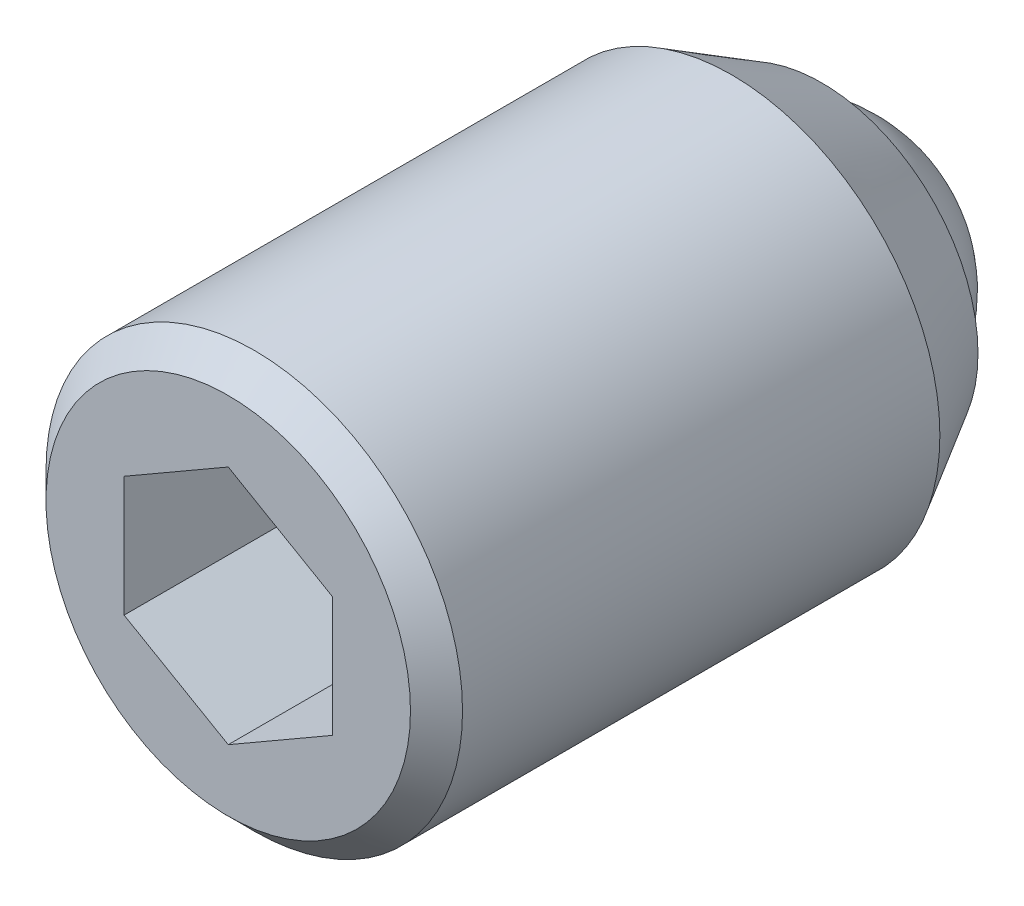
ISO-10303-21;
HEADER;
FILE_DESCRIPTION(('STEP AP214'),'2;1');
FILE_NAME('part.step','',(''),(''),'','','');
FILE_SCHEMA(('AUTOMOTIVE_DESIGN { 1 0 10303 214 1 1 1 1 }'));
ENDSEC;
DATA;
#1=APPLICATION_CONTEXT('core data for automotive mechanical design processes');
#2=APPLICATION_PROTOCOL_DEFINITION('international standard','automotive_design',2000,#1);
#3=PRODUCT_CONTEXT('',#1,'mechanical');
#4=PRODUCT('Part','Part','',(#3));
#5=PRODUCT_RELATED_PRODUCT_CATEGORY('part','',(#4));
#6=PRODUCT_DEFINITION_FORMATION('','',#4);
#7=PRODUCT_DEFINITION_CONTEXT('part definition',#1,'design');
#8=PRODUCT_DEFINITION('design','',#6,#7);
#9=PRODUCT_DEFINITION_SHAPE('','',#8);
#10=(LENGTH_UNIT() NAMED_UNIT(*) SI_UNIT(.MILLI.,.METRE.));
#11=(NAMED_UNIT(*) PLANE_ANGLE_UNIT() SI_UNIT($,.RADIAN.));
#12=(NAMED_UNIT(*) SI_UNIT($,.STERADIAN.) SOLID_ANGLE_UNIT());
#13=UNCERTAINTY_MEASURE_WITH_UNIT(LENGTH_MEASURE(1.E-05),#10,'distance_accuracy_value','');
#14=(GEOMETRIC_REPRESENTATION_CONTEXT(3) GLOBAL_UNCERTAINTY_ASSIGNED_CONTEXT((#13)) GLOBAL_UNIT_ASSIGNED_CONTEXT((#10,
#11,#12)) REPRESENTATION_CONTEXT('',''));
#15=CARTESIAN_POINT('',(0.,0.,0.));
#16=DIRECTION('',(0.,0.,1.));
#17=DIRECTION('',(1.,0.,0.));
#18=AXIS2_PLACEMENT_3D('',#15,#16,#17);
#19=CARTESIAN_POINT('',(2.,1.15470053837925,10.75));
#20=DIRECTION('',(0.5,0.86602540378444,0.));
#21=DIRECTION('',(0.86602540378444,-0.5,0.));
#22=AXIS2_PLACEMENT_3D('',#19,#20,#21);
#23=PLANE('',#22);
#24=DIRECTION('',(0.,0.,1.));
#25=VECTOR('',#24,1.);
#26=CARTESIAN_POINT('',(2.,1.15470053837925,10.75));
#27=LINE('',#26,#25);
#28=CARTESIAN_POINT('',(2.,1.15470053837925,9.25));
#29=VERTEX_POINT('',#28);
#30=CARTESIAN_POINT('',(2.,1.15470053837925,13.25));
#31=VERTEX_POINT('',#30);
#32=EDGE_CURVE('E68',#29,#31,#27,.T.);
#33=ORIENTED_EDGE('',*,*,#32,.T.);
#34=DIRECTION('',(-0.86602540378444,0.5,0.));
#35=VECTOR('',#34,1.);
#36=CARTESIAN_POINT('',(2.,1.15470053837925,13.25));
#37=LINE('',#36,#35);
#38=CARTESIAN_POINT('',(0.,2.3094010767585,13.25));
#39=VERTEX_POINT('',#38);
#40=EDGE_CURVE('E29',#31,#39,#37,.T.);
#41=ORIENTED_EDGE('',*,*,#40,.T.);
#42=DIRECTION('',(0.,0.,1.));
#43=VECTOR('',#42,1.);
#44=CARTESIAN_POINT('',(0.,2.3094010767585,10.75));
#45=LINE('',#44,#43);
#46=CARTESIAN_POINT('',(0.,2.3094010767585,9.25));
#47=VERTEX_POINT('',#46);
#48=EDGE_CURVE('E80',#47,#39,#45,.T.);
#49=ORIENTED_EDGE('',*,*,#48,.F.);
#50=DIRECTION('',(-0.86602540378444,0.5,0.));
#51=VECTOR('',#50,1.);
#52=CARTESIAN_POINT('',(2.,1.15470053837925,9.25));
#53=LINE('',#52,#51);
#54=EDGE_CURVE('E79',#29,#47,#53,.T.);
#55=ORIENTED_EDGE('',*,*,#54,.F.);
#56=EDGE_LOOP('',(#33,#41,#49,#55));
#57=FACE_BOUND('',#56,.T.);
#58=ADVANCED_FACE('F14',(#57),#23,.F.);
#59=CARTESIAN_POINT('',(2.,-1.15470053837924,10.75));
#60=DIRECTION('',(1.,0.,0.));
#61=DIRECTION('',(0.,0.,1.));
#62=AXIS2_PLACEMENT_3D('',#59,#60,#61);
#63=PLANE('',#62);
#64=DIRECTION('',(0.,0.,1.));
#65=VECTOR('',#64,1.);
#66=CARTESIAN_POINT('',(2.,-1.15470053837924,10.75));
#67=LINE('',#66,#65);
#68=CARTESIAN_POINT('',(2.,-1.15470053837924,9.25));
#69=VERTEX_POINT('',#68);
#70=CARTESIAN_POINT('',(2.,-1.15470053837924,13.25));
#71=VERTEX_POINT('',#70);
#72=EDGE_CURVE('E76',#69,#71,#67,.T.);
#73=ORIENTED_EDGE('',*,*,#72,.T.);
#74=DIRECTION('',(0.,1.,0.));
#75=VECTOR('',#74,1.);
#76=CARTESIAN_POINT('',(2.,-1.15470053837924,13.25));
#77=LINE('',#76,#75);
#78=EDGE_CURVE('E75',#71,#31,#77,.T.);
#79=ORIENTED_EDGE('',*,*,#78,.T.);
#80=ORIENTED_EDGE('',*,*,#32,.F.);
#81=DIRECTION('',(0.,1.,0.));
#82=VECTOR('',#81,1.);
#83=CARTESIAN_POINT('',(2.,-1.15470053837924,9.25));
#84=LINE('',#83,#82);
#85=EDGE_CURVE('E72',#69,#29,#84,.T.);
#86=ORIENTED_EDGE('',*,*,#85,.F.);
#87=EDGE_LOOP('',(#73,#79,#80,#86));
#88=FACE_BOUND('',#87,.T.);
#89=ADVANCED_FACE('F70',(#88),#63,.F.);
#90=CARTESIAN_POINT('',(2.,-1.15470053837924,10.75));
#91=DIRECTION('',(-0.5,0.866025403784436,0.));
#92=DIRECTION('',(0.866025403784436,0.5,0.));
#93=AXIS2_PLACEMENT_3D('',#90,#91,#92);
#94=PLANE('',#93);
#95=DIRECTION('',(0.,0.,1.));
#96=VECTOR('',#95,1.);
#97=CARTESIAN_POINT('',(0.,-2.30940107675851,10.75));
#98=LINE('',#97,#96);
#99=CARTESIAN_POINT('',(0.,-2.30940107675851,9.25));
#100=VERTEX_POINT('',#99);
#101=CARTESIAN_POINT('',(0.,-2.30940107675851,13.25));
#102=VERTEX_POINT('',#101);
#103=EDGE_CURVE('E122',#100,#102,#98,.T.);
#104=ORIENTED_EDGE('',*,*,#103,.T.);
#105=DIRECTION('',(-0.866025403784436,-0.5,0.));
#106=VECTOR('',#105,1.);
#107=CARTESIAN_POINT('',(2.,-1.15470053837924,13.25));
#108=LINE('',#107,#106);
#109=EDGE_CURVE('E113',#71,#102,#108,.T.);
#110=ORIENTED_EDGE('',*,*,#109,.F.);
#111=ORIENTED_EDGE('',*,*,#72,.F.);
#112=DIRECTION('',(0.866025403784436,0.5,0.));
#113=VECTOR('',#112,1.);
#114=CARTESIAN_POINT('',(0.,-2.30940107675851,9.25));
#115=LINE('',#114,#113);
#116=EDGE_CURVE('E89',#100,#69,#115,.T.);
#117=ORIENTED_EDGE('',*,*,#116,.F.);
#118=EDGE_LOOP('',(#104,#110,#111,#117));
#119=FACE_BOUND('',#118,.T.);
#120=ADVANCED_FACE('F147',(#119),#94,.T.);
#121=CARTESIAN_POINT('',(-2.,-1.15470053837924,10.75));
#122=DIRECTION('',(-0.5,-0.866025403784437,0.));
#123=DIRECTION('',(-0.866025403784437,0.5,0.));
#124=AXIS2_PLACEMENT_3D('',#121,#122,#123);
#125=PLANE('',#124);
#126=DIRECTION('',(0.,0.,1.));
#127=VECTOR('',#126,1.);
#128=CARTESIAN_POINT('',(-2.,-1.15470053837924,10.75));
#129=LINE('',#128,#127);
#130=CARTESIAN_POINT('',(-2.,-1.15470053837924,9.25));
#131=VERTEX_POINT('',#130);
#132=CARTESIAN_POINT('',(-2.,-1.15470053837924,13.25));
#133=VERTEX_POINT('',#132);
#134=EDGE_CURVE('E120',#131,#133,#129,.T.);
#135=ORIENTED_EDGE('',*,*,#134,.T.);
#136=DIRECTION('',(0.866025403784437,-0.5,0.));
#137=VECTOR('',#136,1.);
#138=CARTESIAN_POINT('',(-2.,-1.15470053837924,13.25));
#139=LINE('',#138,#137);
#140=EDGE_CURVE('E111',#133,#102,#139,.T.);
#141=ORIENTED_EDGE('',*,*,#140,.T.);
#142=ORIENTED_EDGE('',*,*,#103,.F.);
#143=DIRECTION('',(0.866025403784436,-0.5,0.));
#144=VECTOR('',#143,1.);
#145=CARTESIAN_POINT('',(-2.,-1.15470053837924,9.25));
#146=LINE('',#145,#144);
#147=EDGE_CURVE('E101',#131,#100,#146,.T.);
#148=ORIENTED_EDGE('',*,*,#147,.F.);
#149=EDGE_LOOP('',(#135,#141,#142,#148));
#150=FACE_BOUND('',#149,.T.);
#151=ADVANCED_FACE('F157',(#150),#125,.F.);
#152=CARTESIAN_POINT('',(-2.,-1.15470053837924,10.75));
#153=DIRECTION('',(1.,0.,0.));
#154=DIRECTION('',(0.,0.,1.));
#155=AXIS2_PLACEMENT_3D('',#152,#153,#154);
#156=PLANE('',#155);
#157=DIRECTION('',(0.,0.,1.));
#158=VECTOR('',#157,1.);
#159=CARTESIAN_POINT('',(-2.,1.15470053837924,10.75));
#160=LINE('',#159,#158);
#161=CARTESIAN_POINT('',(-2.,1.15470053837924,9.25));
#162=VERTEX_POINT('',#161);
#163=CARTESIAN_POINT('',(-2.,1.15470053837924,13.25));
#164=VERTEX_POINT('',#163);
#165=EDGE_CURVE('E37',#162,#164,#160,.T.);
#166=ORIENTED_EDGE('',*,*,#165,.T.);
#167=DIRECTION('',(0.,1.,0.));
#168=VECTOR('',#167,1.);
#169=CARTESIAN_POINT('',(-2.,-1.15470053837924,13.25));
#170=LINE('',#169,#168);
#171=EDGE_CURVE('E108',#133,#164,#170,.T.);
#172=ORIENTED_EDGE('',*,*,#171,.F.);
#173=ORIENTED_EDGE('',*,*,#134,.F.);
#174=DIRECTION('',(0.,-1.,0.));
#175=VECTOR('',#174,1.);
#176=CARTESIAN_POINT('',(-2.,1.15470053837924,9.25));
#177=LINE('',#176,#175);
#178=EDGE_CURVE('E98',#162,#131,#177,.T.);
#179=ORIENTED_EDGE('',*,*,#178,.F.);
#180=EDGE_LOOP('',(#166,#172,#173,#179));
#181=FACE_BOUND('',#180,.T.);
#182=ADVANCED_FACE('F153',(#181),#156,.T.);
#183=CARTESIAN_POINT('',(-2.,1.15470053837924,10.75));
#184=DIRECTION('',(0.5,-0.866025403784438,0.));
#185=DIRECTION('',(-0.866025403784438,-0.5,0.));
#186=AXIS2_PLACEMENT_3D('',#183,#184,#185);
#187=PLANE('',#186);
#188=ORIENTED_EDGE('',*,*,#165,.F.);
#189=DIRECTION('',(-0.866025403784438,-0.5,0.));
#190=VECTOR('',#189,1.);
#191=CARTESIAN_POINT('',(0.,2.3094010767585,9.25));
#192=LINE('',#191,#190);
#193=EDGE_CURVE('E84',#47,#162,#192,.T.);
#194=ORIENTED_EDGE('',*,*,#193,.F.);
#195=ORIENTED_EDGE('',*,*,#48,.T.);
#196=DIRECTION('',(0.866025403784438,0.5,0.));
#197=VECTOR('',#196,1.);
#198=CARTESIAN_POINT('',(-2.,1.15470053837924,13.25));
#199=LINE('',#198,#197);
#200=EDGE_CURVE('E105',#164,#39,#199,.T.);
#201=ORIENTED_EDGE('',*,*,#200,.F.);
#202=EDGE_LOOP('',(#188,#194,#195,#201));
#203=FACE_BOUND('',#202,.T.);
#204=ADVANCED_FACE('F150',(#203),#187,.T.);
#205=CARTESIAN_POINT('',(0.,0.,13.));
#206=DIRECTION('',(0.,0.,-1.));
#207=DIRECTION('',(1.,0.,0.));
#208=AXIS2_PLACEMENT_3D('',#205,#206,#207);
#209=CYLINDRICAL_SURFACE('',#208,4.);
#210=CARTESIAN_POINT('',(0.,0.,12.75));
#211=DIRECTION('',(0.,0.,-1.));
#212=DIRECTION('',(1.,0.,0.));
#213=AXIS2_PLACEMENT_3D('',#210,#211,#212);
#214=CIRCLE('',#213,4.);
#215=CARTESIAN_POINT('',(4.,0.,12.75));
#216=VERTEX_POINT('',#215);
#217=EDGE_CURVE('E9',#216,#216,#214,.T.);
#218=ORIENTED_EDGE('',*,*,#217,.T.);
#219=EDGE_LOOP('',(#218));
#220=FACE_BOUND('',#219,.T.);
#221=CARTESIAN_POINT('',(0.,0.,3.58205080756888));
#222=DIRECTION('',(0.,0.,-1.));
#223=DIRECTION('',(-1.,0.,0.));
#224=AXIS2_PLACEMENT_3D('',#221,#222,#223);
#225=CIRCLE('',#224,4.);
#226=CARTESIAN_POINT('',(-4.,0.,3.58205080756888));
#227=VERTEX_POINT('',#226);
#228=EDGE_CURVE('E244',#227,#227,#225,.T.);
#229=ORIENTED_EDGE('',*,*,#228,.F.);
#230=EDGE_LOOP('',(#229));
#231=FACE_BOUND('',#230,.T.);
#232=ADVANCED_FACE('F16',(#220,#231),#209,.T.);
#233=CARTESIAN_POINT('',(0.,0.,12.75));
#234=DIRECTION('',(0.,0.,-1.));
#235=DIRECTION('',(1.,0.,0.));
#236=AXIS2_PLACEMENT_3D('',#233,#234,#235);
#237=CONICAL_SURFACE('',#236,4.,0.785398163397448);
#238=CARTESIAN_POINT('',(0.,0.,13.25));
#239=DIRECTION('',(0.,0.,-1.));
#240=DIRECTION('',(1.,0.,0.));
#241=AXIS2_PLACEMENT_3D('',#238,#239,#240);
#242=CIRCLE('',#241,3.5);
#243=CARTESIAN_POINT('',(3.5,0.,13.25));
#244=VERTEX_POINT('',#243);
#245=EDGE_CURVE('E22',#244,#244,#242,.T.);
#246=ORIENTED_EDGE('',*,*,#245,.T.);
#247=EDGE_LOOP('',(#246));
#248=FACE_BOUND('',#247,.T.);
#249=ORIENTED_EDGE('',*,*,#217,.F.);
#250=EDGE_LOOP('',(#249));
#251=FACE_BOUND('',#250,.T.);
#252=ADVANCED_FACE('F127',(#248,#251),#237,.T.);
#253=CARTESIAN_POINT('',(0.,0.,13.25));
#254=DIRECTION('',(0.,0.,-1.));
#255=DIRECTION('',(1.,0.,0.));
#256=AXIS2_PLACEMENT_3D('',#253,#254,#255);
#257=PLANE('',#256);
#258=ORIENTED_EDGE('',*,*,#200,.T.);
#259=ORIENTED_EDGE('',*,*,#40,.F.);
#260=ORIENTED_EDGE('',*,*,#78,.F.);
#261=ORIENTED_EDGE('',*,*,#109,.T.);
#262=ORIENTED_EDGE('',*,*,#140,.F.);
#263=ORIENTED_EDGE('',*,*,#171,.T.);
#264=EDGE_LOOP('',(#258,#259,#260,#261,#262,#263));
#265=FACE_BOUND('',#264,.T.);
#266=ORIENTED_EDGE('',*,*,#245,.F.);
#267=EDGE_LOOP('',(#266));
#268=FACE_BOUND('',#267,.T.);
#269=ADVANCED_FACE('F130',(#265,#268),#257,.F.);
#270=CARTESIAN_POINT('',(2.,1.15470053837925,9.25));
#271=DIRECTION('',(0.,0.,1.));
#272=DIRECTION('',(1.,0.,0.));
#273=AXIS2_PLACEMENT_3D('',#270,#271,#272);
#274=PLANE('',#273);
#275=ORIENTED_EDGE('',*,*,#85,.T.);
#276=ORIENTED_EDGE('',*,*,#54,.T.);
#277=ORIENTED_EDGE('',*,*,#193,.T.);
#278=ORIENTED_EDGE('',*,*,#178,.T.);
#279=ORIENTED_EDGE('',*,*,#147,.T.);
#280=ORIENTED_EDGE('',*,*,#116,.T.);
#281=EDGE_LOOP('',(#275,#276,#277,#278,#279,#280));
#282=FACE_BOUND('',#281,.T.);
#283=ADVANCED_FACE('F86',(#282),#274,.T.);
#284=CARTESIAN_POINT('',(0.,0.,2.75));
#285=DIRECTION('',(0.,0.,-1.));
#286=DIRECTION('',(-1.,0.,0.));
#287=AXIS2_PLACEMENT_3D('',#284,#285,#286);
#288=SPHERICAL_SURFACE('',#287,2.75);
#289=CARTESIAN_POINT('',(0.,0.,1.85));
#290=DIRECTION('',(0.,0.,-1.));
#291=DIRECTION('',(-1.,0.,0.));
#292=AXIS2_PLACEMENT_3D('',#289,#290,#291);
#293=CIRCLE('',#292,2.59855729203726);
#294=CARTESIAN_POINT('',(-2.59855729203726,0.,1.85));
#295=VERTEX_POINT('',#294);
#296=EDGE_CURVE('E90',#295,#295,#293,.T.);
#297=ORIENTED_EDGE('',*,*,#296,.T.);
#298=EDGE_LOOP('',(#297));
#299=FACE_BOUND('',#298,.T.);
#300=ADVANCED_FACE('F139',(#299),#288,.T.);
#301=CARTESIAN_POINT('',(-2.59855729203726,0.,1.85));
#302=DIRECTION('',(0.,0.,-1.));
#303=DIRECTION('',(-1.,0.,0.));
#304=AXIS2_PLACEMENT_3D('',#301,#302,#303);
#305=PLANE('',#304);
#306=CARTESIAN_POINT('',(0.,0.,1.85));
#307=DIRECTION('',(0.,0.,-1.));
#308=DIRECTION('',(-1.,0.,0.));
#309=AXIS2_PLACEMENT_3D('',#306,#307,#308);
#310=CIRCLE('',#309,3.);
#311=CARTESIAN_POINT('',(-3.,0.,1.85));
#312=VERTEX_POINT('',#311);
#313=EDGE_CURVE('E93',#312,#312,#310,.T.);
#314=ORIENTED_EDGE('',*,*,#313,.T.);
#315=EDGE_LOOP('',(#314));
#316=FACE_BOUND('',#315,.T.);
#317=ORIENTED_EDGE('',*,*,#296,.F.);
#318=EDGE_LOOP('',(#317));
#319=FACE_BOUND('',#318,.T.);
#320=ADVANCED_FACE('F216',(#316,#319),#305,.T.);
#321=CARTESIAN_POINT('',(0.,0.,1.85));
#322=DIRECTION('',(0.,0.,1.));
#323=DIRECTION('',(1.,0.,0.));
#324=AXIS2_PLACEMENT_3D('',#321,#322,#323);
#325=CONICAL_SURFACE('',#324,3.,0.523598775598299);
#326=ORIENTED_EDGE('',*,*,#228,.T.);
#327=EDGE_LOOP('',(#326));
#328=FACE_BOUND('',#327,.T.);
#329=ORIENTED_EDGE('',*,*,#313,.F.);
#330=EDGE_LOOP('',(#329));
#331=FACE_BOUND('',#330,.T.);
#332=ADVANCED_FACE('F225',(#328,#331),#325,.T.);
#333=CLOSED_SHELL('',(#58,#89,#120,#151,#182,#204,#232,#252,#269,#283,#300,#320,#332));
#334=MANIFOLD_SOLID_BREP('B1',#333);
#335=ADVANCED_BREP_SHAPE_REPRESENTATION('',(#18,#334),#14);
#336=SHAPE_DEFINITION_REPRESENTATION(#9,#335);
ENDSEC;
END-ISO-10303-21;
